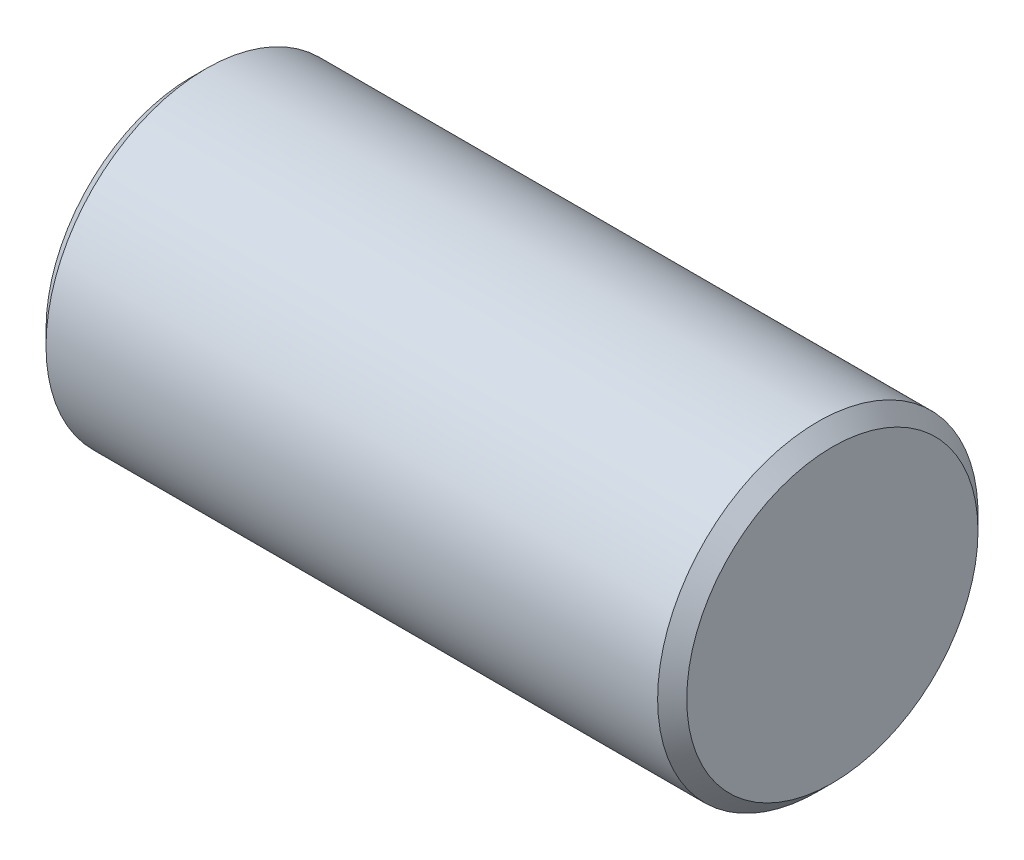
from build123d import *

# Parameters (mm, degrees)
ESQUISSE1_W     = 44
ESQUISSE1_H     = 11
CHANFREIN1_SIZE = 1


with BuildPart() as part:
    # Esquisse1 → R_volution1 (revolve)
    with BuildSketch(Plane.XY, mode=Mode.PRIVATE) as r_volution1_sk:
        with Locations((22, -5.5)):
            Rectangle(ESQUISSE1_W, ESQUISSE1_H)
    revolve(r_volution1_sk.sketch.rotate(Axis((0, -11, 0), (1, 0, 0)), 90), axis=Axis((0, -11, 0), (1, 0, 0)))

    # Chanfrein1
    chanfrein1_edges = [part.edges().sort_by_distance(p)[0] for p in [
        (0, -11, -11),
        (44, -11, -11),
    ]]
    chamfer(chanfrein1_edges, length=CHANFREIN1_SIZE)


solid = part.part
